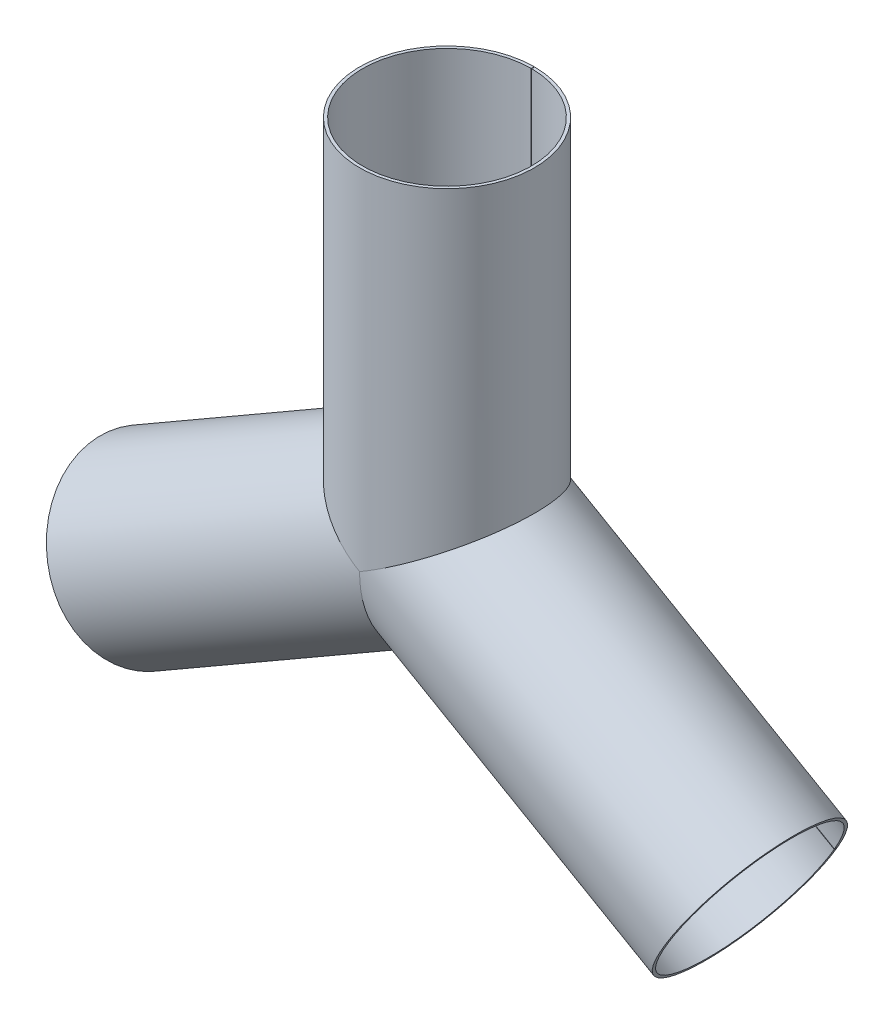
ISO-10303-21;
HEADER;
FILE_DESCRIPTION(('STEP AP214'),'2;1');
FILE_NAME('part.step','',(''),(''),'','','');
FILE_SCHEMA(('AUTOMOTIVE_DESIGN { 1 0 10303 214 1 1 1 1 }'));
ENDSEC;
DATA;
#1=APPLICATION_CONTEXT('core data for automotive mechanical design processes');
#2=APPLICATION_PROTOCOL_DEFINITION('international standard','automotive_design',2000,#1);
#3=PRODUCT_CONTEXT('',#1,'mechanical');
#4=PRODUCT('Part','Part','',(#3));
#5=PRODUCT_RELATED_PRODUCT_CATEGORY('part','',(#4));
#6=PRODUCT_DEFINITION_FORMATION('','',#4);
#7=PRODUCT_DEFINITION_CONTEXT('part definition',#1,'design');
#8=PRODUCT_DEFINITION('design','',#6,#7);
#9=PRODUCT_DEFINITION_SHAPE('','',#8);
#10=(LENGTH_UNIT() NAMED_UNIT(*) SI_UNIT(.MILLI.,.METRE.));
#11=(NAMED_UNIT(*) PLANE_ANGLE_UNIT() SI_UNIT($,.RADIAN.));
#12=(NAMED_UNIT(*) SI_UNIT($,.STERADIAN.) SOLID_ANGLE_UNIT());
#13=UNCERTAINTY_MEASURE_WITH_UNIT(LENGTH_MEASURE(1.E-05),#10,'distance_accuracy_value','');
#14=(GEOMETRIC_REPRESENTATION_CONTEXT(3) GLOBAL_UNCERTAINTY_ASSIGNED_CONTEXT((#13)) GLOBAL_UNIT_ASSIGNED_CONTEXT((#10,
#11,#12)) REPRESENTATION_CONTEXT('',''));
#15=CARTESIAN_POINT('',(0.,0.,0.));
#16=DIRECTION('',(0.,0.,1.));
#17=DIRECTION('',(1.,0.,0.));
#18=AXIS2_PLACEMENT_3D('',#15,#16,#17);
#19=CARTESIAN_POINT('',(606.21778264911,-349.999999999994,0.));
#20=DIRECTION('',(-0.866025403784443,0.499999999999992,0.));
#21=DIRECTION('',(0.,0.,-1.));
#22=AXIS2_PLACEMENT_3D('',#19,#20,#21);
#23=CYLINDRICAL_SURFACE('',#22,175.);
#24=CARTESIAN_POINT('',(606.21778264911,-349.999999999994,0.));
#25=DIRECTION('',(0.866025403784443,-0.499999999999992,0.));
#26=DIRECTION('',(0.,0.,1.));
#27=AXIS2_PLACEMENT_3D('',#24,#25,#26);
#28=CIRCLE('',#27,175.);
#29=CARTESIAN_POINT('',(606.46778264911,-349.566987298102,-174.999285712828));
#30=VERTEX_POINT('',#29);
#31=CARTESIAN_POINT('',(605.96778264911,-350.433012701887,-174.999285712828));
#32=VERTEX_POINT('',#31);
#33=EDGE_CURVE('E105',#30,#32,#28,.T.);
#34=ORIENTED_EDGE('',*,*,#33,.F.);
#35=DIRECTION('',(-0.866025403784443,0.499999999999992,0.));
#36=VECTOR('',#35,1.);
#37=CARTESIAN_POINT('',(606.46778264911,-349.566987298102,-174.999285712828));
#38=LINE('',#37,#36);
#39=CARTESIAN_POINT('',(0.50000000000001,0.288675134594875,-174.999285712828));
#40=VERTEX_POINT('',#39);
#41=EDGE_CURVE('E132',#30,#40,#38,.T.);
#42=ORIENTED_EDGE('',*,*,#41,.T.);
#43=CARTESIAN_POINT('',(0.,0.,0.));
#44=DIRECTION('',(0.50000000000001,-0.866025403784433,0.));
#45=DIRECTION('',(-0.866025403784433,-0.50000000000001,0.));
#46=AXIS2_PLACEMENT_3D('',#43,#44,#45);
#47=ELLIPSE('',#46,202.072594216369,175.);
#48=CARTESIAN_POINT('',(0.,1.66533453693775E-13,175.));
#49=VERTEX_POINT('',#48);
#50=EDGE_CURVE('E115',#40,#49,#47,.T.);
#51=ORIENTED_EDGE('',*,*,#50,.T.);
#52=CARTESIAN_POINT('',(0.,0.,0.));
#53=DIRECTION('',(-1.,0.,0.));
#54=DIRECTION('',(0.,1.,0.));
#55=AXIS2_PLACEMENT_3D('',#52,#53,#54);
#56=ELLIPSE('',#55,202.072594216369,175.);
#57=CARTESIAN_POINT('',(0.,-0.577350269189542,-174.999285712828));
#58=VERTEX_POINT('',#57);
#59=EDGE_CURVE('E107',#58,#49,#56,.T.);
#60=ORIENTED_EDGE('',*,*,#59,.F.);
#61=DIRECTION('',(-0.866025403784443,0.499999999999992,0.));
#62=VECTOR('',#61,1.);
#63=CARTESIAN_POINT('',(605.96778264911,-350.433012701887,-174.999285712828));
#64=LINE('',#63,#62);
#65=EDGE_CURVE('E69',#32,#58,#64,.T.);
#66=ORIENTED_EDGE('',*,*,#65,.F.);
#67=EDGE_LOOP('',(#34,#42,#51,#60,#66));
#68=FACE_BOUND('',#67,.T.);
#69=ADVANCED_FACE('F48',(#68),#23,.T.);
#70=CARTESIAN_POINT('',(4.88498130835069E-12,-700.,1290.40176246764));
#71=DIRECTION('',(-1.,0.,0.));
#72=DIRECTION('',(0.,-1.,0.));
#73=AXIS2_PLACEMENT_3D('',#70,#71,#72);
#74=PLANE('',#73);
#75=CARTESIAN_POINT('',(0.,0.,0.));
#76=DIRECTION('',(-1.,0.,0.));
#77=DIRECTION('',(0.,1.,0.));
#78=AXIS2_PLACEMENT_3D('',#75,#76,#77);
#79=ELLIPSE('',#78,195.144390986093,169.);
#80=CARTESIAN_POINT('',(0.,-0.577350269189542,-168.999260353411));
#81=VERTEX_POINT('',#80);
#82=CARTESIAN_POINT('',(0.,1.66533453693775E-13,169.));
#83=VERTEX_POINT('',#82);
#84=EDGE_CURVE('E124',#81,#83,#79,.T.);
#85=ORIENTED_EDGE('',*,*,#84,.F.);
#86=DIRECTION('',(0.,0.,-1.));
#87=VECTOR('',#86,1.);
#88=CARTESIAN_POINT('',(0.,-0.577350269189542,1290.40176246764));
#89=LINE('',#88,#87);
#90=EDGE_CURVE('E55',#81,#58,#89,.T.);
#91=ORIENTED_EDGE('',*,*,#90,.T.);
#92=ORIENTED_EDGE('',*,*,#59,.T.);
#93=DIRECTION('',(0.,0.,-1.));
#94=VECTOR('',#93,1.);
#95=CARTESIAN_POINT('',(0.,0.,0.));
#96=LINE('',#95,#94);
#97=EDGE_CURVE('E136',#49,#83,#96,.T.);
#98=ORIENTED_EDGE('',*,*,#97,.T.);
#99=EDGE_LOOP('',(#85,#91,#92,#98));
#100=FACE_BOUND('',#99,.T.);
#101=ADVANCED_FACE('F120',(#100),#74,.T.);
#102=CARTESIAN_POINT('',(606.21778264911,-349.999999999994,0.));
#103=DIRECTION('',(-0.866025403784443,0.499999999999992,0.));
#104=DIRECTION('',(0.,0.,-1.));
#105=AXIS2_PLACEMENT_3D('',#102,#103,#104);
#106=CYLINDRICAL_SURFACE('',#105,169.);
#107=DIRECTION('',(-0.866025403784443,0.499999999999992,0.));
#108=VECTOR('',#107,1.);
#109=CARTESIAN_POINT('',(606.46778264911,-349.566987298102,-168.999260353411));
#110=LINE('',#109,#108);
#111=CARTESIAN_POINT('',(606.46778264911,-349.566987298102,-168.999260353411));
#112=VERTEX_POINT('',#111);
#113=CARTESIAN_POINT('',(0.50000000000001,0.288675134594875,-168.999260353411));
#114=VERTEX_POINT('',#113);
#115=EDGE_CURVE('E62',#112,#114,#110,.T.);
#116=ORIENTED_EDGE('',*,*,#115,.F.);
#117=CARTESIAN_POINT('',(606.21778264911,-349.999999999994,0.));
#118=DIRECTION('',(0.866025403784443,-0.499999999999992,0.));
#119=DIRECTION('',(-0.499999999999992,-0.866025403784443,0.));
#120=AXIS2_PLACEMENT_3D('',#117,#118,#119);
#121=CIRCLE('',#120,169.);
#122=CARTESIAN_POINT('',(605.96778264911,-350.433012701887,-168.999260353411));
#123=VERTEX_POINT('',#122);
#124=EDGE_CURVE('E112',#112,#123,#121,.T.);
#125=ORIENTED_EDGE('',*,*,#124,.T.);
#126=DIRECTION('',(-0.866025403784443,0.499999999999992,0.));
#127=VECTOR('',#126,1.);
#128=CARTESIAN_POINT('',(605.96778264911,-350.433012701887,-168.999260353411));
#129=LINE('',#128,#127);
#130=EDGE_CURVE('E94',#123,#81,#129,.T.);
#131=ORIENTED_EDGE('',*,*,#130,.T.);
#132=ORIENTED_EDGE('',*,*,#84,.T.);
#133=CARTESIAN_POINT('',(0.,0.,0.));
#134=DIRECTION('',(0.50000000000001,-0.866025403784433,0.));
#135=DIRECTION('',(-0.866025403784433,-0.50000000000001,0.));
#136=AXIS2_PLACEMENT_3D('',#133,#134,#135);
#137=ELLIPSE('',#136,195.144390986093,169.);
#138=EDGE_CURVE('E111',#114,#83,#137,.T.);
#139=ORIENTED_EDGE('',*,*,#138,.F.);
#140=EDGE_LOOP('',(#116,#125,#131,#132,#139));
#141=FACE_BOUND('',#140,.T.);
#142=ADVANCED_FACE('F126',(#141),#106,.F.);
#143=CARTESIAN_POINT('',(606.21778264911,-349.999999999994,0.));
#144=DIRECTION('',(0.866025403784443,-0.499999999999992,0.));
#145=DIRECTION('',(0.,0.,1.));
#146=AXIS2_PLACEMENT_3D('',#143,#144,#145);
#147=PLANE('',#146);
#148=DIRECTION('',(0.,0.,1.));
#149=VECTOR('',#148,1.);
#150=CARTESIAN_POINT('',(606.46778264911,-349.566987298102,-175.));
#151=LINE('',#150,#149);
#152=EDGE_CURVE('E99',#30,#112,#151,.T.);
#153=ORIENTED_EDGE('',*,*,#152,.F.);
#154=ORIENTED_EDGE('',*,*,#33,.T.);
#155=DIRECTION('',(0.,0.,1.));
#156=VECTOR('',#155,1.);
#157=CARTESIAN_POINT('',(605.96778264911,-350.433012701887,-175.));
#158=LINE('',#157,#156);
#159=EDGE_CURVE('E91',#32,#123,#158,.T.);
#160=ORIENTED_EDGE('',*,*,#159,.T.);
#161=ORIENTED_EDGE('',*,*,#124,.F.);
#162=EDGE_LOOP('',(#153,#154,#160,#161));
#163=FACE_BOUND('',#162,.T.);
#164=ADVANCED_FACE('F110',(#163),#147,.T.);
#165=CARTESIAN_POINT('',(606.217782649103,350.000000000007,1290.40176246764));
#166=DIRECTION('',(0.50000000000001,-0.866025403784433,0.));
#167=DIRECTION('',(0.866025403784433,0.50000000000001,0.));
#168=AXIS2_PLACEMENT_3D('',#165,#166,#167);
#169=PLANE('',#168);
#170=ORIENTED_EDGE('',*,*,#50,.F.);
#171=DIRECTION('',(0.,0.,1.));
#172=VECTOR('',#171,1.);
#173=CARTESIAN_POINT('',(0.50000000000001,0.288675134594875,1290.40176246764));
#174=LINE('',#173,#172);
#175=EDGE_CURVE('E13',#40,#114,#174,.T.);
#176=ORIENTED_EDGE('',*,*,#175,.T.);
#177=ORIENTED_EDGE('',*,*,#138,.T.);
#178=ORIENTED_EDGE('',*,*,#97,.F.);
#179=EDGE_LOOP('',(#170,#176,#177,#178));
#180=FACE_BOUND('',#179,.T.);
#181=ADVANCED_FACE('F139',(#180),#169,.F.);
#182=CARTESIAN_POINT('',(605.96778264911,-350.433012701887,-175.));
#183=DIRECTION('',(0.499999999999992,0.866025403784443,0.));
#184=DIRECTION('',(-0.866025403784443,0.499999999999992,0.));
#185=AXIS2_PLACEMENT_3D('',#182,#183,#184);
#186=PLANE('',#185);
#187=ORIENTED_EDGE('',*,*,#65,.T.);
#188=ORIENTED_EDGE('',*,*,#90,.F.);
#189=ORIENTED_EDGE('',*,*,#130,.F.);
#190=ORIENTED_EDGE('',*,*,#159,.F.);
#191=EDGE_LOOP('',(#187,#188,#189,#190));
#192=FACE_BOUND('',#191,.T.);
#193=ADVANCED_FACE('F92',(#192),#186,.T.);
#194=CARTESIAN_POINT('',(606.46778264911,-349.566987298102,-175.));
#195=DIRECTION('',(0.499999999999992,0.866025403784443,0.));
#196=DIRECTION('',(-0.866025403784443,0.499999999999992,0.));
#197=AXIS2_PLACEMENT_3D('',#194,#195,#196);
#198=PLANE('',#197);
#199=ORIENTED_EDGE('',*,*,#152,.T.);
#200=ORIENTED_EDGE('',*,*,#115,.T.);
#201=ORIENTED_EDGE('',*,*,#175,.F.);
#202=ORIENTED_EDGE('',*,*,#41,.F.);
#203=EDGE_LOOP('',(#199,#200,#201,#202));
#204=FACE_BOUND('',#203,.T.);
#205=ADVANCED_FACE('F140',(#204),#198,.F.);
#206=CLOSED_SHELL('',(#69,#101,#142,#164,#181,#193,#205));
#207=MANIFOLD_SOLID_BREP('B2',#206);
#208=CARTESIAN_POINT('',(-606.217782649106,-350.000000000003,0.));
#209=DIRECTION('',(0.866025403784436,0.500000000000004,0.));
#210=DIRECTION('',(0.,0.,-1.));
#211=AXIS2_PLACEMENT_3D('',#208,#209,#210);
#212=CYLINDRICAL_SURFACE('',#211,175.);
#213=CARTESIAN_POINT('',(-606.217782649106,-350.000000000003,0.));
#214=DIRECTION('',(-0.866025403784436,-0.500000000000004,0.));
#215=DIRECTION('',(0.,0.,1.));
#216=AXIS2_PLACEMENT_3D('',#213,#214,#215);
#217=CIRCLE('',#216,175.);
#218=CARTESIAN_POINT('',(-605.967782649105,-350.433012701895,-174.999285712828));
#219=VERTEX_POINT('',#218);
#220=CARTESIAN_POINT('',(-606.467782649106,-349.566987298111,-174.999285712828));
#221=VERTEX_POINT('',#220);
#222=EDGE_CURVE('E264',#219,#221,#217,.T.);
#223=ORIENTED_EDGE('',*,*,#222,.F.);
#224=DIRECTION('',(0.866025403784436,0.500000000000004,0.));
#225=VECTOR('',#224,1.);
#226=CARTESIAN_POINT('',(-605.967782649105,-350.433012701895,-174.999285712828));
#227=LINE('',#226,#225);
#228=CARTESIAN_POINT('',(0.,-0.577350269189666,-174.999285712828));
#229=VERTEX_POINT('',#228);
#230=EDGE_CURVE('E291',#219,#229,#227,.T.);
#231=ORIENTED_EDGE('',*,*,#230,.T.);
#232=CARTESIAN_POINT('',(0.,0.,0.));
#233=DIRECTION('',(-1.,0.,0.));
#234=DIRECTION('',(0.,1.,0.));
#235=AXIS2_PLACEMENT_3D('',#232,#233,#234);
#236=ELLIPSE('',#235,202.072594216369,175.);
#237=CARTESIAN_POINT('',(0.,-1.66533453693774E-13,175.));
#238=VERTEX_POINT('',#237);
#239=EDGE_CURVE('E274',#229,#238,#236,.T.);
#240=ORIENTED_EDGE('',*,*,#239,.T.);
#241=CARTESIAN_POINT('',(0.,0.,0.));
#242=DIRECTION('',(0.499999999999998,0.86602540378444,0.));
#243=DIRECTION('',(0.86602540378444,-0.499999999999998,0.));
#244=AXIS2_PLACEMENT_3D('',#241,#242,#243);
#245=ELLIPSE('',#244,202.072594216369,175.);
#246=CARTESIAN_POINT('',(-0.499999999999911,0.288675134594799,-174.999285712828));
#247=VERTEX_POINT('',#246);
#248=EDGE_CURVE('E266',#247,#238,#245,.T.);
#249=ORIENTED_EDGE('',*,*,#248,.F.);
#250=DIRECTION('',(0.866025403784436,0.500000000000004,0.));
#251=VECTOR('',#250,1.);
#252=CARTESIAN_POINT('',(-606.467782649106,-349.566987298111,-174.999285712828));
#253=LINE('',#252,#251);
#254=EDGE_CURVE('E228',#221,#247,#253,.T.);
#255=ORIENTED_EDGE('',*,*,#254,.F.);
#256=EDGE_LOOP('',(#223,#231,#240,#249,#255));
#257=FACE_BOUND('',#256,.T.);
#258=ADVANCED_FACE('F207',(#257),#212,.T.);
#259=CARTESIAN_POINT('',(-606.217782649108,349.999999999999,1290.40176246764));
#260=DIRECTION('',(0.499999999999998,0.86602540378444,0.));
#261=DIRECTION('',(-0.86602540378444,0.499999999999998,0.));
#262=AXIS2_PLACEMENT_3D('',#259,#260,#261);
#263=PLANE('',#262);
#264=CARTESIAN_POINT('',(0.,0.,0.));
#265=DIRECTION('',(0.499999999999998,0.86602540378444,0.));
#266=DIRECTION('',(0.86602540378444,-0.499999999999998,0.));
#267=AXIS2_PLACEMENT_3D('',#264,#265,#266);
#268=ELLIPSE('',#267,195.144390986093,169.);
#269=CARTESIAN_POINT('',(-0.499999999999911,0.288675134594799,-168.999260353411));
#270=VERTEX_POINT('',#269);
#271=CARTESIAN_POINT('',(0.,-1.66533453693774E-13,169.));
#272=VERTEX_POINT('',#271);
#273=EDGE_CURVE('E283',#270,#272,#268,.T.);
#274=ORIENTED_EDGE('',*,*,#273,.F.);
#275=DIRECTION('',(0.,0.,-1.));
#276=VECTOR('',#275,1.);
#277=CARTESIAN_POINT('',(-0.499999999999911,0.288675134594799,1290.40176246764));
#278=LINE('',#277,#276);
#279=EDGE_CURVE('E214',#270,#247,#278,.T.);
#280=ORIENTED_EDGE('',*,*,#279,.T.);
#281=ORIENTED_EDGE('',*,*,#248,.T.);
#282=DIRECTION('',(0.,0.,-1.));
#283=VECTOR('',#282,1.);
#284=CARTESIAN_POINT('',(0.,0.,0.));
#285=LINE('',#284,#283);
#286=EDGE_CURVE('E295',#238,#272,#285,.T.);
#287=ORIENTED_EDGE('',*,*,#286,.T.);
#288=EDGE_LOOP('',(#274,#280,#281,#287));
#289=FACE_BOUND('',#288,.T.);
#290=ADVANCED_FACE('F279',(#289),#263,.T.);
#291=CARTESIAN_POINT('',(-606.217782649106,-350.000000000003,0.));
#292=DIRECTION('',(0.866025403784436,0.500000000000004,0.));
#293=DIRECTION('',(0.,0.,-1.));
#294=AXIS2_PLACEMENT_3D('',#291,#292,#293);
#295=CYLINDRICAL_SURFACE('',#294,169.);
#296=DIRECTION('',(0.866025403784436,0.500000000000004,0.));
#297=VECTOR('',#296,1.);
#298=CARTESIAN_POINT('',(-605.967782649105,-350.433012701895,-168.999260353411));
#299=LINE('',#298,#297);
#300=CARTESIAN_POINT('',(-605.967782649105,-350.433012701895,-168.999260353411));
#301=VERTEX_POINT('',#300);
#302=CARTESIAN_POINT('',(0.,-0.577350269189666,-168.999260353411));
#303=VERTEX_POINT('',#302);
#304=EDGE_CURVE('E221',#301,#303,#299,.T.);
#305=ORIENTED_EDGE('',*,*,#304,.F.);
#306=CARTESIAN_POINT('',(-606.217782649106,-350.000000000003,0.));
#307=DIRECTION('',(-0.866025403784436,-0.500000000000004,0.));
#308=DIRECTION('',(-0.500000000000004,0.866025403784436,0.));
#309=AXIS2_PLACEMENT_3D('',#306,#307,#308);
#310=CIRCLE('',#309,169.);
#311=CARTESIAN_POINT('',(-606.467782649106,-349.566987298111,-168.999260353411));
#312=VERTEX_POINT('',#311);
#313=EDGE_CURVE('E271',#301,#312,#310,.T.);
#314=ORIENTED_EDGE('',*,*,#313,.T.);
#315=DIRECTION('',(0.866025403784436,0.500000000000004,0.));
#316=VECTOR('',#315,1.);
#317=CARTESIAN_POINT('',(-606.467782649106,-349.566987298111,-168.999260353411));
#318=LINE('',#317,#316);
#319=EDGE_CURVE('E253',#312,#270,#318,.T.);
#320=ORIENTED_EDGE('',*,*,#319,.T.);
#321=ORIENTED_EDGE('',*,*,#273,.T.);
#322=CARTESIAN_POINT('',(0.,0.,0.));
#323=DIRECTION('',(-1.,0.,0.));
#324=DIRECTION('',(0.,1.,0.));
#325=AXIS2_PLACEMENT_3D('',#322,#323,#324);
#326=ELLIPSE('',#325,195.144390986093,169.);
#327=EDGE_CURVE('E270',#303,#272,#326,.T.);
#328=ORIENTED_EDGE('',*,*,#327,.F.);
#329=EDGE_LOOP('',(#305,#314,#320,#321,#328));
#330=FACE_BOUND('',#329,.T.);
#331=ADVANCED_FACE('F285',(#330),#295,.F.);
#332=CARTESIAN_POINT('',(-606.217782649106,-350.000000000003,0.));
#333=DIRECTION('',(-0.866025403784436,-0.500000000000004,0.));
#334=DIRECTION('',(0.,0.,1.));
#335=AXIS2_PLACEMENT_3D('',#332,#333,#334);
#336=PLANE('',#335);
#337=DIRECTION('',(0.,0.,1.));
#338=VECTOR('',#337,1.);
#339=CARTESIAN_POINT('',(-605.967782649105,-350.433012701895,-175.));
#340=LINE('',#339,#338);
#341=EDGE_CURVE('E258',#219,#301,#340,.T.);
#342=ORIENTED_EDGE('',*,*,#341,.F.);
#343=ORIENTED_EDGE('',*,*,#222,.T.);
#344=DIRECTION('',(0.,0.,1.));
#345=VECTOR('',#344,1.);
#346=CARTESIAN_POINT('',(-606.467782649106,-349.566987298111,-175.));
#347=LINE('',#346,#345);
#348=EDGE_CURVE('E250',#221,#312,#347,.T.);
#349=ORIENTED_EDGE('',*,*,#348,.T.);
#350=ORIENTED_EDGE('',*,*,#313,.F.);
#351=EDGE_LOOP('',(#342,#343,#349,#350));
#352=FACE_BOUND('',#351,.T.);
#353=ADVANCED_FACE('F269',(#352),#336,.T.);
#354=CARTESIAN_POINT('',(4.9960036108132E-12,-700.,1290.40176246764));
#355=DIRECTION('',(-1.,0.,0.));
#356=DIRECTION('',(0.,-1.,0.));
#357=AXIS2_PLACEMENT_3D('',#354,#355,#356);
#358=PLANE('',#357);
#359=ORIENTED_EDGE('',*,*,#239,.F.);
#360=DIRECTION('',(0.,0.,1.));
#361=VECTOR('',#360,1.);
#362=CARTESIAN_POINT('',(0.,-0.577350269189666,1290.40176246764));
#363=LINE('',#362,#361);
#364=EDGE_CURVE('E46',#229,#303,#363,.T.);
#365=ORIENTED_EDGE('',*,*,#364,.T.);
#366=ORIENTED_EDGE('',*,*,#327,.T.);
#367=ORIENTED_EDGE('',*,*,#286,.F.);
#368=EDGE_LOOP('',(#359,#365,#366,#367));
#369=FACE_BOUND('',#368,.T.);
#370=ADVANCED_FACE('F298',(#369),#358,.F.);
#371=CARTESIAN_POINT('',(-606.467782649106,-349.566987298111,-175.));
#372=DIRECTION('',(0.500000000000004,-0.866025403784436,0.));
#373=DIRECTION('',(0.866025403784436,0.500000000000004,0.));
#374=AXIS2_PLACEMENT_3D('',#371,#372,#373);
#375=PLANE('',#374);
#376=ORIENTED_EDGE('',*,*,#254,.T.);
#377=ORIENTED_EDGE('',*,*,#279,.F.);
#378=ORIENTED_EDGE('',*,*,#319,.F.);
#379=ORIENTED_EDGE('',*,*,#348,.F.);
#380=EDGE_LOOP('',(#376,#377,#378,#379));
#381=FACE_BOUND('',#380,.T.);
#382=ADVANCED_FACE('F251',(#381),#375,.T.);
#383=CARTESIAN_POINT('',(-605.967782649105,-350.433012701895,-175.));
#384=DIRECTION('',(0.500000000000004,-0.866025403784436,0.));
#385=DIRECTION('',(0.866025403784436,0.500000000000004,0.));
#386=AXIS2_PLACEMENT_3D('',#383,#384,#385);
#387=PLANE('',#386);
#388=ORIENTED_EDGE('',*,*,#341,.T.);
#389=ORIENTED_EDGE('',*,*,#304,.T.);
#390=ORIENTED_EDGE('',*,*,#364,.F.);
#391=ORIENTED_EDGE('',*,*,#230,.F.);
#392=EDGE_LOOP('',(#388,#389,#390,#391));
#393=FACE_BOUND('',#392,.T.);
#394=ADVANCED_FACE('F299',(#393),#387,.F.);
#395=CLOSED_SHELL('',(#258,#290,#331,#353,#370,#382,#394));
#396=MANIFOLD_SOLID_BREP('B7',#395);
#397=CARTESIAN_POINT('',(0.,700.,0.));
#398=DIRECTION('',(0.,-1.,0.));
#399=DIRECTION('',(0.,0.,-1.));
#400=AXIS2_PLACEMENT_3D('',#397,#398,#399);
#401=CYLINDRICAL_SURFACE('',#400,175.);
#402=CARTESIAN_POINT('',(0.,700.,0.));
#403=DIRECTION('',(0.,1.,0.));
#404=DIRECTION('',(0.,0.,1.));
#405=AXIS2_PLACEMENT_3D('',#402,#403,#404);
#406=CIRCLE('',#405,175.);
#407=CARTESIAN_POINT('',(-0.50000000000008,700.,-174.999285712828));
#408=VERTEX_POINT('',#407);
#409=CARTESIAN_POINT('',(0.49999999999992,700.,-174.999285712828));
#410=VERTEX_POINT('',#409);
#411=EDGE_CURVE('E414',#408,#410,#406,.T.);
#412=ORIENTED_EDGE('',*,*,#411,.F.);
#413=DIRECTION('',(0.,-1.,0.));
#414=VECTOR('',#413,1.);
#415=CARTESIAN_POINT('',(-0.50000000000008,700.,-174.999285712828));
#416=LINE('',#415,#414);
#417=CARTESIAN_POINT('',(-0.500000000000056,0.288675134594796,-174.999285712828));
#418=VERTEX_POINT('',#417);
#419=EDGE_CURVE('E441',#408,#418,#416,.T.);
#420=ORIENTED_EDGE('',*,*,#419,.T.);
#421=CARTESIAN_POINT('',(0.,-1.11022302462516E-13,0.));
#422=DIRECTION('',(0.499999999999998,0.86602540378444,0.));
#423=DIRECTION('',(0.86602540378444,-0.499999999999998,0.));
#424=AXIS2_PLACEMENT_3D('',#421,#422,#423);
#425=ELLIPSE('',#424,202.072594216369,175.);
#426=CARTESIAN_POINT('',(-1.92296268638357E-13,0.,175.));
#427=VERTEX_POINT('',#426);
#428=EDGE_CURVE('E424',#418,#427,#425,.T.);
#429=ORIENTED_EDGE('',*,*,#428,.T.);
#430=CARTESIAN_POINT('',(0.,0.,0.));
#431=DIRECTION('',(0.499999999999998,-0.86602540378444,0.));
#432=DIRECTION('',(-0.86602540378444,-0.499999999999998,0.));
#433=AXIS2_PLACEMENT_3D('',#430,#431,#432);
#434=ELLIPSE('',#433,202.072594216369,175.);
#435=CARTESIAN_POINT('',(0.499999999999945,0.28867513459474,-174.999285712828));
#436=VERTEX_POINT('',#435);
#437=EDGE_CURVE('E416',#436,#427,#434,.T.);
#438=ORIENTED_EDGE('',*,*,#437,.F.);
#439=DIRECTION('',(0.,-1.,0.));
#440=VECTOR('',#439,1.);
#441=CARTESIAN_POINT('',(0.49999999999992,700.,-174.999285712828));
#442=LINE('',#441,#440);
#443=EDGE_CURVE('E378',#410,#436,#442,.T.);
#444=ORIENTED_EDGE('',*,*,#443,.F.);
#445=EDGE_LOOP('',(#412,#420,#429,#438,#444));
#446=FACE_BOUND('',#445,.T.);
#447=ADVANCED_FACE('F357',(#446),#401,.T.);
#448=CARTESIAN_POINT('',(606.217782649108,349.999999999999,1290.40176246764));
#449=DIRECTION('',(0.499999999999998,-0.86602540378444,0.));
#450=DIRECTION('',(0.86602540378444,0.499999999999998,0.));
#451=AXIS2_PLACEMENT_3D('',#448,#449,#450);
#452=PLANE('',#451);
#453=CARTESIAN_POINT('',(0.,0.,0.));
#454=DIRECTION('',(0.499999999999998,-0.86602540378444,0.));
#455=DIRECTION('',(-0.86602540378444,-0.499999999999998,0.));
#456=AXIS2_PLACEMENT_3D('',#453,#454,#455);
#457=ELLIPSE('',#456,195.144390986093,169.);
#458=CARTESIAN_POINT('',(0.499999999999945,0.28867513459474,-168.999260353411));
#459=VERTEX_POINT('',#458);
#460=CARTESIAN_POINT('',(-1.92296268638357E-13,0.,169.));
#461=VERTEX_POINT('',#460);
#462=EDGE_CURVE('E433',#459,#461,#457,.T.);
#463=ORIENTED_EDGE('',*,*,#462,.F.);
#464=DIRECTION('',(0.,0.,-1.));
#465=VECTOR('',#464,1.);
#466=CARTESIAN_POINT('',(0.499999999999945,0.28867513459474,1290.40176246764));
#467=LINE('',#466,#465);
#468=EDGE_CURVE('E364',#459,#436,#467,.T.);
#469=ORIENTED_EDGE('',*,*,#468,.T.);
#470=ORIENTED_EDGE('',*,*,#437,.T.);
#471=DIRECTION('',(0.,0.,-1.));
#472=VECTOR('',#471,1.);
#473=CARTESIAN_POINT('',(-1.11022302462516E-13,0.,0.));
#474=LINE('',#473,#472);
#475=EDGE_CURVE('E445',#427,#461,#474,.T.);
#476=ORIENTED_EDGE('',*,*,#475,.T.);
#477=EDGE_LOOP('',(#463,#469,#470,#476));
#478=FACE_BOUND('',#477,.T.);
#479=ADVANCED_FACE('F429',(#478),#452,.T.);
#480=CARTESIAN_POINT('',(0.,700.,0.));
#481=DIRECTION('',(0.,-1.,0.));
#482=DIRECTION('',(0.,0.,-1.));
#483=AXIS2_PLACEMENT_3D('',#480,#481,#482);
#484=CYLINDRICAL_SURFACE('',#483,169.);
#485=DIRECTION('',(0.,-1.,0.));
#486=VECTOR('',#485,1.);
#487=CARTESIAN_POINT('',(-0.50000000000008,700.,-168.999260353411));
#488=LINE('',#487,#486);
#489=CARTESIAN_POINT('',(-0.50000000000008,700.,-168.999260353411));
#490=VERTEX_POINT('',#489);
#491=CARTESIAN_POINT('',(-0.500000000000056,0.288675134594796,-168.999260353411));
#492=VERTEX_POINT('',#491);
#493=EDGE_CURVE('E371',#490,#492,#488,.T.);
#494=ORIENTED_EDGE('',*,*,#493,.F.);
#495=CARTESIAN_POINT('',(0.,700.,0.));
#496=DIRECTION('',(0.,1.,0.));
#497=DIRECTION('',(1.,0.,0.));
#498=AXIS2_PLACEMENT_3D('',#495,#496,#497);
#499=CIRCLE('',#498,169.);
#500=CARTESIAN_POINT('',(0.49999999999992,700.,-168.999260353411));
#501=VERTEX_POINT('',#500);
#502=EDGE_CURVE('E421',#490,#501,#499,.T.);
#503=ORIENTED_EDGE('',*,*,#502,.T.);
#504=DIRECTION('',(0.,-1.,0.));
#505=VECTOR('',#504,1.);
#506=CARTESIAN_POINT('',(0.49999999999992,700.,-168.999260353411));
#507=LINE('',#506,#505);
#508=EDGE_CURVE('E403',#501,#459,#507,.T.);
#509=ORIENTED_EDGE('',*,*,#508,.T.);
#510=ORIENTED_EDGE('',*,*,#462,.T.);
#511=CARTESIAN_POINT('',(0.,-1.11022302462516E-13,0.));
#512=DIRECTION('',(0.499999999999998,0.86602540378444,0.));
#513=DIRECTION('',(0.86602540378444,-0.499999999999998,0.));
#514=AXIS2_PLACEMENT_3D('',#511,#512,#513);
#515=ELLIPSE('',#514,195.144390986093,169.);
#516=EDGE_CURVE('E420',#492,#461,#515,.T.);
#517=ORIENTED_EDGE('',*,*,#516,.F.);
#518=EDGE_LOOP('',(#494,#503,#509,#510,#517));
#519=FACE_BOUND('',#518,.T.);
#520=ADVANCED_FACE('F435',(#519),#484,.F.);
#521=CARTESIAN_POINT('',(0.,700.,0.));
#522=DIRECTION('',(0.,1.,0.));
#523=DIRECTION('',(0.,0.,1.));
#524=AXIS2_PLACEMENT_3D('',#521,#522,#523);
#525=PLANE('',#524);
#526=DIRECTION('',(0.,0.,1.));
#527=VECTOR('',#526,1.);
#528=CARTESIAN_POINT('',(-0.50000000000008,700.,-175.));
#529=LINE('',#528,#527);
#530=EDGE_CURVE('E408',#408,#490,#529,.T.);
#531=ORIENTED_EDGE('',*,*,#530,.F.);
#532=ORIENTED_EDGE('',*,*,#411,.T.);
#533=DIRECTION('',(0.,0.,1.));
#534=VECTOR('',#533,1.);
#535=CARTESIAN_POINT('',(0.49999999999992,700.,-175.));
#536=LINE('',#535,#534);
#537=EDGE_CURVE('E400',#410,#501,#536,.T.);
#538=ORIENTED_EDGE('',*,*,#537,.T.);
#539=ORIENTED_EDGE('',*,*,#502,.F.);
#540=EDGE_LOOP('',(#531,#532,#538,#539));
#541=FACE_BOUND('',#540,.T.);
#542=ADVANCED_FACE('F419',(#541),#525,.T.);
#543=CARTESIAN_POINT('',(-606.217782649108,349.999999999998,1290.40176246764));
#544=DIRECTION('',(0.499999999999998,0.86602540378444,0.));
#545=DIRECTION('',(-0.86602540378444,0.499999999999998,0.));
#546=AXIS2_PLACEMENT_3D('',#543,#544,#545);
#547=PLANE('',#546);
#548=ORIENTED_EDGE('',*,*,#428,.F.);
#549=DIRECTION('',(0.,0.,1.));
#550=VECTOR('',#549,1.);
#551=CARTESIAN_POINT('',(-0.500000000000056,0.288675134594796,1290.40176246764));
#552=LINE('',#551,#550);
#553=EDGE_CURVE('E205',#418,#492,#552,.T.);
#554=ORIENTED_EDGE('',*,*,#553,.T.);
#555=ORIENTED_EDGE('',*,*,#516,.T.);
#556=ORIENTED_EDGE('',*,*,#475,.F.);
#557=EDGE_LOOP('',(#548,#554,#555,#556));
#558=FACE_BOUND('',#557,.T.);
#559=ADVANCED_FACE('F448',(#558),#547,.F.);
#560=CARTESIAN_POINT('',(0.49999999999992,700.,-175.));
#561=DIRECTION('',(-1.,0.,0.));
#562=DIRECTION('',(0.,-1.,0.));
#563=AXIS2_PLACEMENT_3D('',#560,#561,#562);
#564=PLANE('',#563);
#565=ORIENTED_EDGE('',*,*,#443,.T.);
#566=ORIENTED_EDGE('',*,*,#468,.F.);
#567=ORIENTED_EDGE('',*,*,#508,.F.);
#568=ORIENTED_EDGE('',*,*,#537,.F.);
#569=EDGE_LOOP('',(#565,#566,#567,#568));
#570=FACE_BOUND('',#569,.T.);
#571=ADVANCED_FACE('F401',(#570),#564,.T.);
#572=CARTESIAN_POINT('',(-0.50000000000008,700.,-175.));
#573=DIRECTION('',(-1.,0.,0.));
#574=DIRECTION('',(0.,-1.,0.));
#575=AXIS2_PLACEMENT_3D('',#572,#573,#574);
#576=PLANE('',#575);
#577=ORIENTED_EDGE('',*,*,#530,.T.);
#578=ORIENTED_EDGE('',*,*,#493,.T.);
#579=ORIENTED_EDGE('',*,*,#553,.F.);
#580=ORIENTED_EDGE('',*,*,#419,.F.);
#581=EDGE_LOOP('',(#577,#578,#579,#580));
#582=FACE_BOUND('',#581,.T.);
#583=ADVANCED_FACE('F449',(#582),#576,.F.);
#584=CLOSED_SHELL('',(#447,#479,#520,#542,#559,#571,#583));
#585=MANIFOLD_SOLID_BREP('B40',#584);
#586=ADVANCED_BREP_SHAPE_REPRESENTATION('',(#18,#207,#396,#585),#14);
#587=SHAPE_DEFINITION_REPRESENTATION(#9,#586);
ENDSEC;
END-ISO-10303-21;
